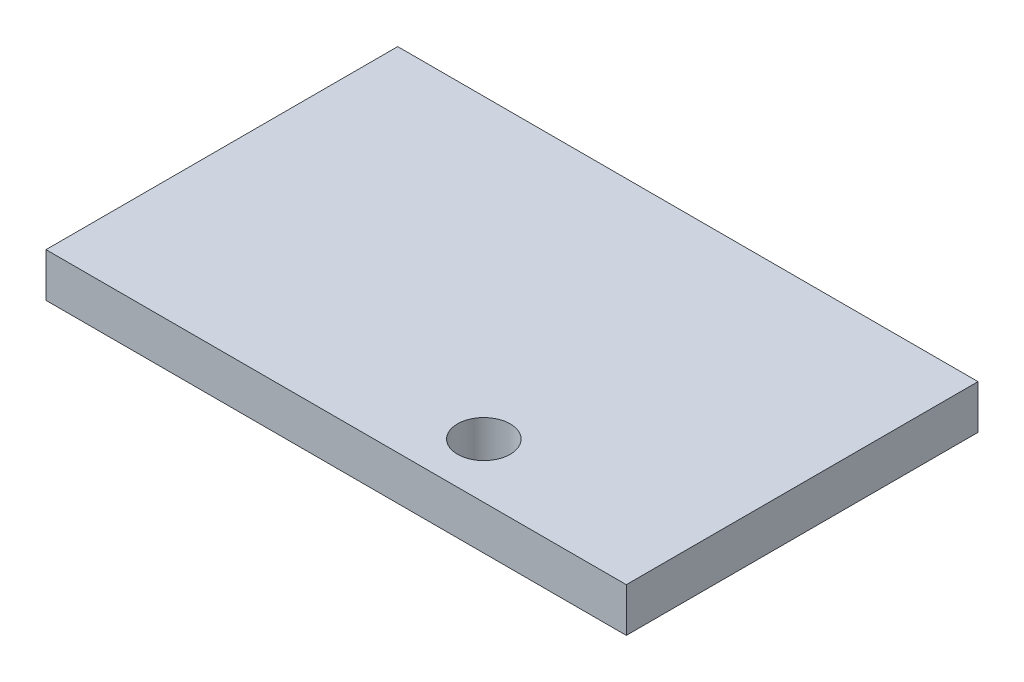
ISO-10303-21;
HEADER;
FILE_DESCRIPTION(('STEP AP214'),'2;1');
FILE_NAME('part.step','',(''),(''),'','','');
FILE_SCHEMA(('AUTOMOTIVE_DESIGN { 1 0 10303 214 1 1 1 1 }'));
ENDSEC;
DATA;
#1=APPLICATION_CONTEXT('core data for automotive mechanical design processes');
#2=APPLICATION_PROTOCOL_DEFINITION('international standard','automotive_design',2000,#1);
#3=PRODUCT_CONTEXT('',#1,'mechanical');
#4=PRODUCT('Part','Part','',(#3));
#5=PRODUCT_RELATED_PRODUCT_CATEGORY('part','',(#4));
#6=PRODUCT_DEFINITION_FORMATION('','',#4);
#7=PRODUCT_DEFINITION_CONTEXT('part definition',#1,'design');
#8=PRODUCT_DEFINITION('design','',#6,#7);
#9=PRODUCT_DEFINITION_SHAPE('','',#8);
#10=(LENGTH_UNIT() NAMED_UNIT(*) SI_UNIT(.MILLI.,.METRE.));
#11=(NAMED_UNIT(*) PLANE_ANGLE_UNIT() SI_UNIT($,.RADIAN.));
#12=(NAMED_UNIT(*) SI_UNIT($,.STERADIAN.) SOLID_ANGLE_UNIT());
#13=UNCERTAINTY_MEASURE_WITH_UNIT(LENGTH_MEASURE(1.E-05),#10,'distance_accuracy_value','');
#14=(GEOMETRIC_REPRESENTATION_CONTEXT(3) GLOBAL_UNCERTAINTY_ASSIGNED_CONTEXT((#13)) GLOBAL_UNIT_ASSIGNED_CONTEXT((#10,
#11,#12)) REPRESENTATION_CONTEXT('',''));
#15=CARTESIAN_POINT('',(0.,0.,0.));
#16=DIRECTION('',(0.,0.,1.));
#17=DIRECTION('',(1.,0.,0.));
#18=AXIS2_PLACEMENT_3D('',#15,#16,#17);
#19=CARTESIAN_POINT('',(-17.0070921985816,2.5,-9.2836879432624));
#20=DIRECTION('',(1.,0.,0.));
#21=DIRECTION('',(0.,0.,-1.));
#22=AXIS2_PLACEMENT_3D('',#19,#20,#21);
#23=PLANE('',#22);
#24=DIRECTION('',(0.,0.,1.));
#25=VECTOR('',#24,1.);
#26=CARTESIAN_POINT('',(-17.0070921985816,0.,-9.2836879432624));
#27=LINE('',#26,#25);
#28=CARTESIAN_POINT('',(-17.0070921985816,0.,-9.2836879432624));
#29=VERTEX_POINT('',#28);
#30=CARTESIAN_POINT('',(-17.0070921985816,0.,10.7163120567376));
#31=VERTEX_POINT('',#30);
#32=EDGE_CURVE('E107',#29,#31,#27,.T.);
#33=ORIENTED_EDGE('',*,*,#32,.T.);
#34=DIRECTION('',(0.,-1.,0.));
#35=VECTOR('',#34,1.);
#36=CARTESIAN_POINT('',(-17.0070921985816,2.5,10.7163120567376));
#37=LINE('',#36,#35);
#38=CARTESIAN_POINT('',(-17.0070921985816,2.5,10.7163120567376));
#39=VERTEX_POINT('',#38);
#40=EDGE_CURVE('E11',#39,#31,#37,.T.);
#41=ORIENTED_EDGE('',*,*,#40,.F.);
#42=DIRECTION('',(0.,0.,1.));
#43=VECTOR('',#42,1.);
#44=CARTESIAN_POINT('',(-17.0070921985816,2.5,-9.2836879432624));
#45=LINE('',#44,#43);
#46=CARTESIAN_POINT('',(-17.0070921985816,2.5,-9.2836879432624));
#47=VERTEX_POINT('',#46);
#48=EDGE_CURVE('E91',#47,#39,#45,.T.);
#49=ORIENTED_EDGE('',*,*,#48,.F.);
#50=DIRECTION('',(0.,-1.,0.));
#51=VECTOR('',#50,1.);
#52=CARTESIAN_POINT('',(-17.0070921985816,2.5,-9.2836879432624));
#53=LINE('',#52,#51);
#54=EDGE_CURVE('E103',#47,#29,#53,.T.);
#55=ORIENTED_EDGE('',*,*,#54,.T.);
#56=EDGE_LOOP('',(#33,#41,#49,#55));
#57=FACE_BOUND('',#56,.T.);
#58=ADVANCED_FACE('F39',(#57),#23,.F.);
#59=CARTESIAN_POINT('',(-17.0070921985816,2.5,10.7163120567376));
#60=DIRECTION('',(0.,0.,-1.));
#61=DIRECTION('',(-1.,0.,0.));
#62=AXIS2_PLACEMENT_3D('',#59,#60,#61);
#63=PLANE('',#62);
#64=DIRECTION('',(1.,0.,0.));
#65=VECTOR('',#64,1.);
#66=CARTESIAN_POINT('',(-17.0070921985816,0.,10.7163120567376));
#67=LINE('',#66,#65);
#68=CARTESIAN_POINT('',(15.9929078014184,0.,10.7163120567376));
#69=VERTEX_POINT('',#68);
#70=EDGE_CURVE('E96',#31,#69,#67,.T.);
#71=ORIENTED_EDGE('',*,*,#70,.T.);
#72=DIRECTION('',(0.,-1.,0.));
#73=VECTOR('',#72,1.);
#74=CARTESIAN_POINT('',(15.9929078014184,2.5,10.7163120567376));
#75=LINE('',#74,#73);
#76=CARTESIAN_POINT('',(15.9929078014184,2.5,10.7163120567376));
#77=VERTEX_POINT('',#76);
#78=EDGE_CURVE('E48',#77,#69,#75,.T.);
#79=ORIENTED_EDGE('',*,*,#78,.F.);
#80=DIRECTION('',(1.,0.,0.));
#81=VECTOR('',#80,1.);
#82=CARTESIAN_POINT('',(-17.0070921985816,2.5,10.7163120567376));
#83=LINE('',#82,#81);
#84=EDGE_CURVE('E86',#39,#77,#83,.T.);
#85=ORIENTED_EDGE('',*,*,#84,.F.);
#86=ORIENTED_EDGE('',*,*,#40,.T.);
#87=EDGE_LOOP('',(#71,#79,#85,#86));
#88=FACE_BOUND('',#87,.T.);
#89=ADVANCED_FACE('F95',(#88),#63,.F.);
#90=CARTESIAN_POINT('',(15.9929078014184,2.5,-9.2836879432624));
#91=DIRECTION('',(-1.,0.,0.));
#92=DIRECTION('',(0.,0.,1.));
#93=AXIS2_PLACEMENT_3D('',#90,#91,#92);
#94=PLANE('',#93);
#95=DIRECTION('',(0.,0.,-1.));
#96=VECTOR('',#95,1.);
#97=CARTESIAN_POINT('',(15.9929078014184,0.,-9.2836879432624));
#98=LINE('',#97,#96);
#99=CARTESIAN_POINT('',(15.9929078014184,0.,-9.2836879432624));
#100=VERTEX_POINT('',#99);
#101=EDGE_CURVE('E73',#69,#100,#98,.T.);
#102=ORIENTED_EDGE('',*,*,#101,.T.);
#103=DIRECTION('',(0.,-1.,0.));
#104=VECTOR('',#103,1.);
#105=CARTESIAN_POINT('',(15.9929078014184,2.5,-9.2836879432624));
#106=LINE('',#105,#104);
#107=CARTESIAN_POINT('',(15.9929078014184,2.5,-9.2836879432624));
#108=VERTEX_POINT('',#107);
#109=EDGE_CURVE('E98',#108,#100,#106,.T.);
#110=ORIENTED_EDGE('',*,*,#109,.F.);
#111=DIRECTION('',(0.,0.,-1.));
#112=VECTOR('',#111,1.);
#113=CARTESIAN_POINT('',(15.9929078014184,2.5,-9.2836879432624));
#114=LINE('',#113,#112);
#115=EDGE_CURVE('E89',#77,#108,#114,.T.);
#116=ORIENTED_EDGE('',*,*,#115,.F.);
#117=ORIENTED_EDGE('',*,*,#78,.T.);
#118=EDGE_LOOP('',(#102,#110,#116,#117));
#119=FACE_BOUND('',#118,.T.);
#120=ADVANCED_FACE('F99',(#119),#94,.F.);
#121=CARTESIAN_POINT('',(-17.0070921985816,2.5,-9.2836879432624));
#122=DIRECTION('',(0.,0.,1.));
#123=DIRECTION('',(1.,0.,0.));
#124=AXIS2_PLACEMENT_3D('',#121,#122,#123);
#125=PLANE('',#124);
#126=DIRECTION('',(-1.,0.,0.));
#127=VECTOR('',#126,1.);
#128=CARTESIAN_POINT('',(-17.0070921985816,0.,-9.2836879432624));
#129=LINE('',#128,#127);
#130=EDGE_CURVE('E79',#100,#29,#129,.T.);
#131=ORIENTED_EDGE('',*,*,#130,.T.);
#132=ORIENTED_EDGE('',*,*,#54,.F.);
#133=DIRECTION('',(-1.,0.,0.));
#134=VECTOR('',#133,1.);
#135=CARTESIAN_POINT('',(-17.0070921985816,2.5,-9.2836879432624));
#136=LINE('',#135,#134);
#137=EDGE_CURVE('E56',#108,#47,#136,.T.);
#138=ORIENTED_EDGE('',*,*,#137,.F.);
#139=ORIENTED_EDGE('',*,*,#109,.T.);
#140=EDGE_LOOP('',(#131,#132,#138,#139));
#141=FACE_BOUND('',#140,.T.);
#142=ADVANCED_FACE('F121',(#141),#125,.F.);
#143=CARTESIAN_POINT('',(0.,2.5,0.));
#144=DIRECTION('',(0.,1.,0.));
#145=DIRECTION('',(0.,0.,1.));
#146=AXIS2_PLACEMENT_3D('',#143,#144,#145);
#147=PLANE('',#146);
#148=CARTESIAN_POINT('',(4.77277698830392,2.5,7.59674209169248));
#149=DIRECTION('',(0.,1.,0.));
#150=DIRECTION('',(0.,0.,1.));
#151=AXIS2_PLACEMENT_3D('',#148,#149,#150);
#152=CIRCLE('',#151,1.5);
#153=CARTESIAN_POINT('',(4.77277698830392,2.5,9.09674209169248));
#154=VERTEX_POINT('',#153);
#155=EDGE_CURVE('E128',#154,#154,#152,.T.);
#156=ORIENTED_EDGE('',*,*,#155,.F.);
#157=EDGE_LOOP('',(#156));
#158=FACE_BOUND('',#157,.T.);
#159=ORIENTED_EDGE('',*,*,#48,.T.);
#160=ORIENTED_EDGE('',*,*,#84,.T.);
#161=ORIENTED_EDGE('',*,*,#115,.T.);
#162=ORIENTED_EDGE('',*,*,#137,.T.);
#163=EDGE_LOOP('',(#159,#160,#161,#162));
#164=FACE_BOUND('',#163,.T.);
#165=ADVANCED_FACE('F87',(#158,#164),#147,.T.);
#166=CARTESIAN_POINT('',(0.,0.,0.));
#167=DIRECTION('',(0.,1.,0.));
#168=DIRECTION('',(0.,0.,1.));
#169=AXIS2_PLACEMENT_3D('',#166,#167,#168);
#170=PLANE('',#169);
#171=CARTESIAN_POINT('',(4.77277698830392,0.,7.59674209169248));
#172=DIRECTION('',(0.,1.,0.));
#173=DIRECTION('',(0.,0.,1.));
#174=AXIS2_PLACEMENT_3D('',#171,#172,#173);
#175=CIRCLE('',#174,1.5);
#176=CARTESIAN_POINT('',(4.77277698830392,0.,9.09674209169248));
#177=VERTEX_POINT('',#176);
#178=EDGE_CURVE('E111',#177,#177,#175,.T.);
#179=ORIENTED_EDGE('',*,*,#178,.T.);
#180=EDGE_LOOP('',(#179));
#181=FACE_BOUND('',#180,.T.);
#182=ORIENTED_EDGE('',*,*,#32,.F.);
#183=ORIENTED_EDGE('',*,*,#130,.F.);
#184=ORIENTED_EDGE('',*,*,#101,.F.);
#185=ORIENTED_EDGE('',*,*,#70,.F.);
#186=EDGE_LOOP('',(#182,#183,#184,#185));
#187=FACE_BOUND('',#186,.T.);
#188=ADVANCED_FACE('F124',(#181,#187),#170,.F.);
#189=CARTESIAN_POINT('',(4.77277698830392,0.,7.59674209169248));
#190=DIRECTION('',(0.,1.,0.));
#191=DIRECTION('',(0.,0.,1.));
#192=AXIS2_PLACEMENT_3D('',#189,#190,#191);
#193=CYLINDRICAL_SURFACE('',#192,1.5);
#194=ORIENTED_EDGE('',*,*,#178,.F.);
#195=EDGE_LOOP('',(#194));
#196=FACE_BOUND('',#195,.T.);
#197=ORIENTED_EDGE('',*,*,#155,.T.);
#198=EDGE_LOOP('',(#197));
#199=FACE_BOUND('',#198,.T.);
#200=ADVANCED_FACE('F137',(#196,#199),#193,.F.);
#201=CLOSED_SHELL('',(#58,#89,#120,#142,#165,#188,#200));
#202=MANIFOLD_SOLID_BREP('B2',#201);
#203=ADVANCED_BREP_SHAPE_REPRESENTATION('',(#18,#202),#14);
#204=SHAPE_DEFINITION_REPRESENTATION(#9,#203);
ENDSEC;
END-ISO-10303-21;
